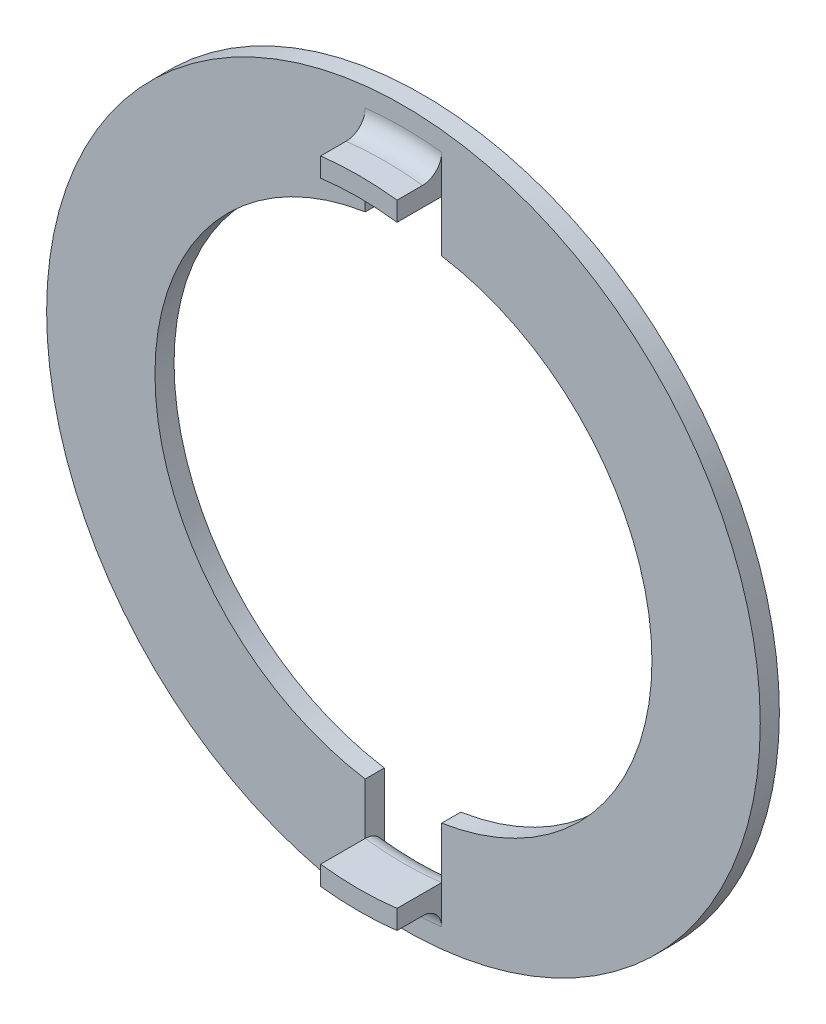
from build123d import *

# Parameters (mm, degrees)
ESQUISSE4_R             = 28
BASE_EXTRUSION_DEPTH    = 1.5
ESQUISSE5_R             = 19.5
ENL_V_MAT_EXTRU_1_DEPTH = 1.5
ENL_V_MAT_EXTRU_2_DEPTH = 1.5
BOSS_EXTRU_2_START      = 3.5
BOSS_EXTRU_2_DEPTH      = 3.5
CONG_1_R                = 1.5


with BuildPart() as part:
    # Esquisse4 → Base-Extrusion (new body)
    with BuildSketch(Plane.XY):
        Circle(ESQUISSE4_R)
    extrude(amount=BASE_EXTRUSION_DEPTH)

    # Esquisse5 → Enl_v. mat.-Extru.1 (cut)
    with BuildSketch(Plane.XY.offset(1.5)):
        Circle(ESQUISSE5_R)
    extrude(amount=-ENL_V_MAT_EXTRU_1_DEPTH, mode=Mode.SUBTRACT)

    # Esquisse6 → Enl_v. mat.-Extru.2 (cut)
    with BuildSketch(Plane.XY.offset(1.5)):
        with BuildLine():
            Line((-3, 23.307724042), (-3, 19.267848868))
            ThreePointArc((-3, 19.267848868), (0, 19.5), (3, 19.267848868))
            Line((3, 19.267848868), (3, 23.307724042))
            ThreePointArc((3, 23.307724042), (0, 23.5), (-3, 23.307724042))
        make_face()
        with BuildLine():
            Line((-3, -19.267848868), (-3, -23.307724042))
            ThreePointArc((-3, -23.307724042), (0, -23.5), (3, -23.307724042))
            Line((3, -23.307724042), (3, -19.267848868))
            ThreePointArc((3, -19.267848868), (0, -19.5), (-3, -19.267848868))
        make_face()
    extrude(amount=-ENL_V_MAT_EXTRU_2_DEPTH, mode=Mode.SUBTRACT)

    # Esquisse8 → Boss.-Extru.2 (add)
    with BuildSketch(Plane.XY.offset(1.5).offset(BOSS_EXTRU_2_START)):
        with BuildLine():
            Line((-3, 24.819347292), (-3, 23.307724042))
            ThreePointArc((-3, 23.307724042), (0, 23.5), (3, 23.307724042))
            Line((3, 23.307724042), (3, 24.819347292))
            ThreePointArc((3, 24.819347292), (0, 25), (-3, 24.819347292))
        make_face()
        with BuildLine():
            Line((3, -23.307724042), (3, -24.819347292))
            ThreePointArc((3, -24.819347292), (0, -25), (-3, -24.819347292))
            Line((-3, -24.819347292), (-3, -23.307724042))
            ThreePointArc((-3, -23.307724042), (0, -23.5), (3, -23.307724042))
        make_face()
    extrude(amount=-BOSS_EXTRU_2_DEPTH)

    # Cong_1
    cong_1_edges = [part.edges().sort_by_distance(p)[0] for p in [
        (0, -23.5, 0),
        (0, 23.5, 0),
        (0, 25, 1.5),
        (0, -25, 1.5),
    ]]
    fillet(cong_1_edges, radius=CONG_1_R)


solid = part.part
